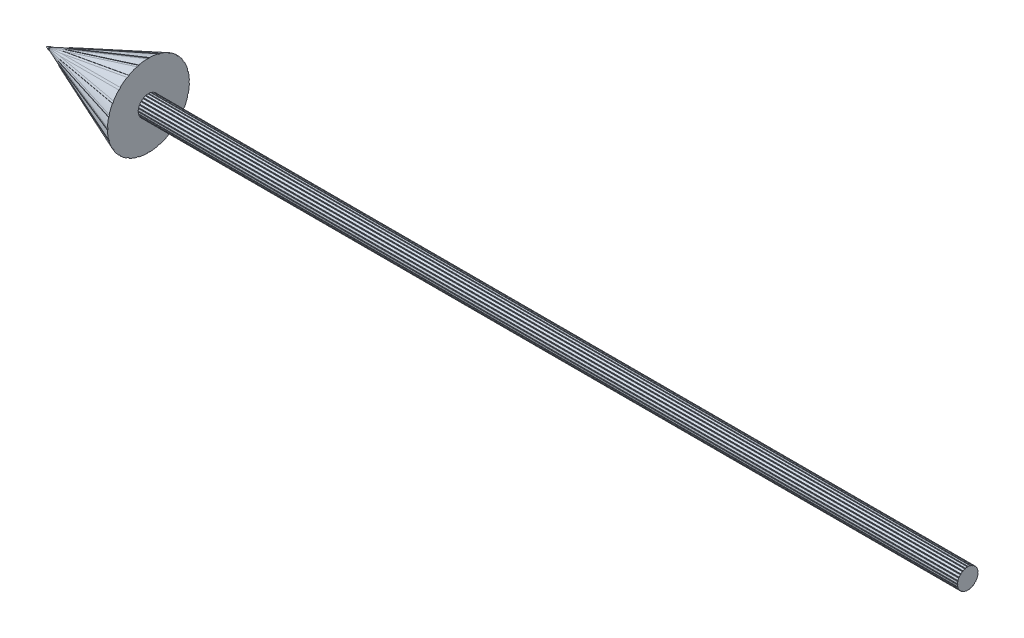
from build123d import *

# Parameters (mm, degrees)
ESQUISSE1_R                  = 0.5
BOSS_EXTRU_1_DEPTH           = 40
ENL_V_MAT_EXTRU_1_DEPTH      = 40
R_P_TITION_CIRCULAIRE1_COUNT = 24
ENL_V_MAT_EXTRU_2_DEPTH      = 0.05
R_P_TITION_CIRCULAIRE2_COUNT = 24


with BuildPart() as part:
    # Esquisse1 → Boss.-Extru.1 (new body)
    with BuildSketch(Plane(origin=(0, 0, 0), x_dir=(0, 0, -1), z_dir=(1, 0, 0))):
        Circle(ESQUISSE1_R)
    extrude(amount=BOSS_EXTRU_1_DEPTH)

    # Esquisse2 → R_volution1 (revolve)
    with BuildSketch(Plane.XY, mode=Mode.PRIVATE) as r_volution1_sk:
        Polygon((0, 0), (0, 2), (-5, 0), align=None)
    revolve(r_volution1_sk.sketch.rotate(Axis((0, 0, 0), (-1, 0, 0)), 90), axis=Axis((0, 0, 0), (-1, 0, 0)))

    # Esquisse3 → Enl_v. mat.-Extru.1 (cut)
    with BuildSketch(Plane(origin=(40, 0, 0), x_dir=(0, 0, -1), z_dir=(1, 0, 0))):
        Polygon((0, 0.48), (-0.05, 0.53), (0.05, 0.53), align=None)
    enl_v_mat_extru_1 = extrude(amount=-ENL_V_MAT_EXTRU_1_DEPTH, mode=Mode.SUBTRACT)

    # R_p_tition circulaire1: Enl_v. mat.-Extru.1 ×24 about axis
    r_p_tition_circulaire1_axis = Axis((0, 0, 0), (1, 0, 0))
    for i in range(1, R_P_TITION_CIRCULAIRE1_COUNT):
        add(enl_v_mat_extru_1.rotate(r_p_tition_circulaire1_axis, i * 360 / R_P_TITION_CIRCULAIRE1_COUNT), mode=Mode.SUBTRACT)

    # Esquisse4 → Enl_v. mat.-Extru.2 (cut, symmetric)
    with BuildSketch(Plane.XY):
        Polygon((0, 1.978459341), (-4.772110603, 0.0696151), (-4.825962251, 0.0696151), (0, 2), align=None)
    enl_v_mat_extru_2 = extrude(amount=ENL_V_MAT_EXTRU_2_DEPTH, both=True, mode=Mode.SUBTRACT)

    # R_p_tition circulaire2: Enl_v. mat.-Extru.2 ×24 about axis
    r_p_tition_circulaire2_axis = Axis((0, 0, 0), (1, 0, 0))
    for i in range(1, R_P_TITION_CIRCULAIRE2_COUNT):
        add(enl_v_mat_extru_2.rotate(r_p_tition_circulaire2_axis, i * 360 / R_P_TITION_CIRCULAIRE2_COUNT), mode=Mode.SUBTRACT)


solid = part.part
